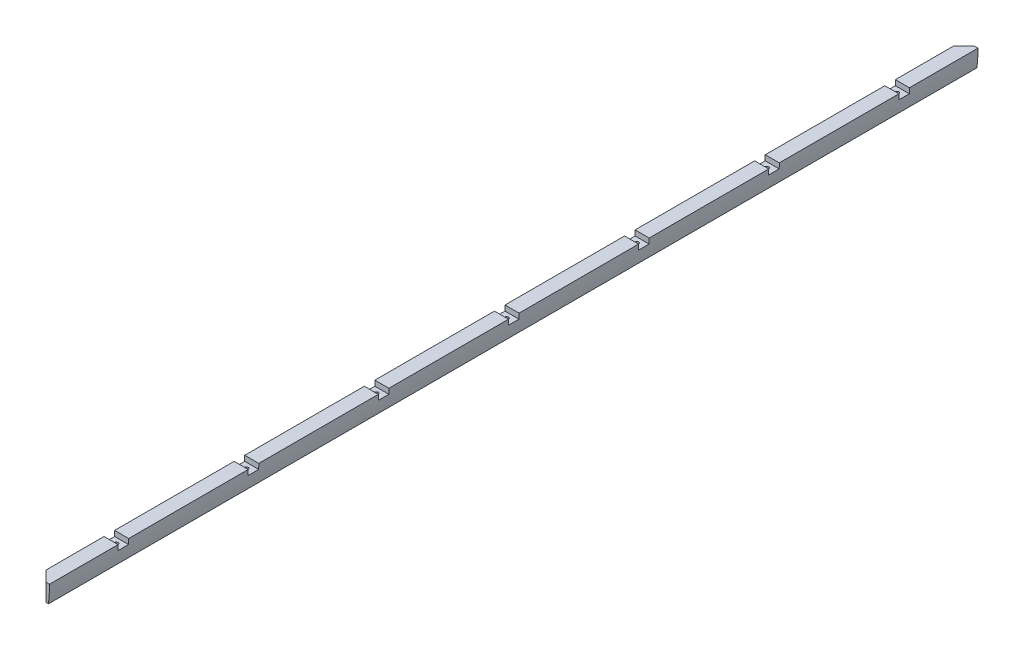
ISO-10303-21;
HEADER;
FILE_DESCRIPTION(('STEP AP214'),'2;1');
FILE_NAME('part.step','',(''),(''),'','','');
FILE_SCHEMA(('AUTOMOTIVE_DESIGN { 1 0 10303 214 1 1 1 1 }'));
ENDSEC;
DATA;
#1=APPLICATION_CONTEXT('core data for automotive mechanical design processes');
#2=APPLICATION_PROTOCOL_DEFINITION('international standard','automotive_design',2000,#1);
#3=PRODUCT_CONTEXT('',#1,'mechanical');
#4=PRODUCT('Part','Part','',(#3));
#5=PRODUCT_RELATED_PRODUCT_CATEGORY('part','',(#4));
#6=PRODUCT_DEFINITION_FORMATION('','',#4);
#7=PRODUCT_DEFINITION_CONTEXT('part definition',#1,'design');
#8=PRODUCT_DEFINITION('design','',#6,#7);
#9=PRODUCT_DEFINITION_SHAPE('','',#8);
#10=(LENGTH_UNIT() NAMED_UNIT(*) SI_UNIT(.MILLI.,.METRE.));
#11=(NAMED_UNIT(*) PLANE_ANGLE_UNIT() SI_UNIT($,.RADIAN.));
#12=(NAMED_UNIT(*) SI_UNIT($,.STERADIAN.) SOLID_ANGLE_UNIT());
#13=UNCERTAINTY_MEASURE_WITH_UNIT(LENGTH_MEASURE(1.E-05),#10,'distance_accuracy_value','');
#14=(GEOMETRIC_REPRESENTATION_CONTEXT(3) GLOBAL_UNCERTAINTY_ASSIGNED_CONTEXT((#13)) GLOBAL_UNIT_ASSIGNED_CONTEXT((#10,
#11,#12)) REPRESENTATION_CONTEXT('',''));
#15=CARTESIAN_POINT('',(0.,0.,0.));
#16=DIRECTION('',(0.,0.,1.));
#17=DIRECTION('',(1.,0.,0.));
#18=AXIS2_PLACEMENT_3D('',#15,#16,#17);
#19=CARTESIAN_POINT('',(234.95,0.,1676.4));
#20=DIRECTION('',(0.,-1.,0.));
#21=DIRECTION('',(0.,0.,-1.));
#22=AXIS2_PLACEMENT_3D('',#19,#20,#21);
#23=PLANE('',#22);
#24=DIRECTION('',(0.,0.,-1.));
#25=VECTOR('',#24,1.);
#26=CARTESIAN_POINT('',(234.95,0.,1676.4));
#27=LINE('',#26,#25);
#28=CARTESIAN_POINT('',(234.95,0.,1657.35));
#29=VERTEX_POINT('',#28);
#30=CARTESIAN_POINT('',(234.95,0.,1552.575));
#31=VERTEX_POINT('',#30);
#32=EDGE_CURVE('E275',#29,#31,#27,.T.);
#33=ORIENTED_EDGE('',*,*,#32,.F.);
#34=DIRECTION('',(-0.707106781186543,0.,-0.707106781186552));
#35=VECTOR('',#34,1.);
#36=CARTESIAN_POINT('',(254.,0.,1676.4));
#37=LINE('',#36,#35);
#38=CARTESIAN_POINT('',(254.,0.,1676.4));
#39=VERTEX_POINT('',#38);
#40=EDGE_CURVE('E422',#39,#29,#37,.T.);
#41=ORIENTED_EDGE('',*,*,#40,.F.);
#42=DIRECTION('',(-1.,0.,0.));
#43=VECTOR('',#42,1.);
#44=CARTESIAN_POINT('',(234.95,0.,1676.4));
#45=LINE('',#44,#43);
#46=CARTESIAN_POINT('',(260.35,0.,1676.4));
#47=VERTEX_POINT('',#46);
#48=EDGE_CURVE('E271',#47,#39,#45,.T.);
#49=ORIENTED_EDGE('',*,*,#48,.F.);
#50=DIRECTION('',(0.,0.,-1.));
#51=VECTOR('',#50,1.);
#52=CARTESIAN_POINT('',(260.35,0.,1676.4));
#53=LINE('',#52,#51);
#54=CARTESIAN_POINT('',(260.35,0.,1552.575));
#55=VERTEX_POINT('',#54);
#56=EDGE_CURVE('E285',#47,#55,#53,.T.);
#57=ORIENTED_EDGE('',*,*,#56,.T.);
#58=DIRECTION('',(1.,0.,0.));
#59=VECTOR('',#58,1.);
#60=CARTESIAN_POINT('',(352.397761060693,0.,1552.575));
#61=LINE('',#60,#59);
#62=EDGE_CURVE('E435',#31,#55,#61,.T.);
#63=ORIENTED_EDGE('',*,*,#62,.F.);
#64=EDGE_LOOP('',(#33,#41,#49,#57,#63));
#65=FACE_BOUND('',#64,.T.);
#66=ADVANCED_FACE('F32',(#65),#23,.F.);
#67=CARTESIAN_POINT('',(234.95,0.,1533.525));
#68=VERTEX_POINT('',#67);
#69=CARTESIAN_POINT('',(234.95,0.,1317.625));
#70=VERTEX_POINT('',#69);
#71=EDGE_CURVE('E284',#68,#70,#27,.T.);
#72=ORIENTED_EDGE('',*,*,#71,.F.);
#73=DIRECTION('',(-1.,0.,0.));
#74=VECTOR('',#73,1.);
#75=CARTESIAN_POINT('',(352.397761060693,0.,1533.525));
#76=LINE('',#75,#74);
#77=CARTESIAN_POINT('',(260.35,0.,1533.525));
#78=VERTEX_POINT('',#77);
#79=EDGE_CURVE('E357',#78,#68,#76,.T.);
#80=ORIENTED_EDGE('',*,*,#79,.F.);
#81=CARTESIAN_POINT('',(260.35,0.,1317.625));
#82=VERTEX_POINT('',#81);
#83=EDGE_CURVE('E289',#78,#82,#53,.T.);
#84=ORIENTED_EDGE('',*,*,#83,.T.);
#85=DIRECTION('',(1.,0.,0.));
#86=VECTOR('',#85,1.);
#87=CARTESIAN_POINT('',(352.397761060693,0.,1317.625));
#88=LINE('',#87,#86);
#89=EDGE_CURVE('E360',#70,#82,#88,.T.);
#90=ORIENTED_EDGE('',*,*,#89,.F.);
#91=EDGE_LOOP('',(#72,#80,#84,#90));
#92=FACE_BOUND('',#91,.T.);
#93=ADVANCED_FACE('F356',(#92),#23,.F.);
#94=CARTESIAN_POINT('',(234.95,0.,1298.575));
#95=VERTEX_POINT('',#94);
#96=CARTESIAN_POINT('',(234.95,0.,1082.675));
#97=VERTEX_POINT('',#96);
#98=EDGE_CURVE('E361',#95,#97,#27,.T.);
#99=ORIENTED_EDGE('',*,*,#98,.F.);
#100=DIRECTION('',(-1.,0.,0.));
#101=VECTOR('',#100,1.);
#102=CARTESIAN_POINT('',(352.397761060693,0.,1298.575));
#103=LINE('',#102,#101);
#104=CARTESIAN_POINT('',(260.35,0.,1298.575));
#105=VERTEX_POINT('',#104);
#106=EDGE_CURVE('E449',#105,#95,#103,.T.);
#107=ORIENTED_EDGE('',*,*,#106,.F.);
#108=CARTESIAN_POINT('',(260.35,0.,1082.675));
#109=VERTEX_POINT('',#108);
#110=EDGE_CURVE('E603',#105,#109,#53,.T.);
#111=ORIENTED_EDGE('',*,*,#110,.T.);
#112=DIRECTION('',(1.,0.,0.));
#113=VECTOR('',#112,1.);
#114=CARTESIAN_POINT('',(352.397761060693,0.,1082.675));
#115=LINE('',#114,#113);
#116=EDGE_CURVE('E470',#97,#109,#115,.T.);
#117=ORIENTED_EDGE('',*,*,#116,.F.);
#118=EDGE_LOOP('',(#99,#107,#111,#117));
#119=FACE_BOUND('',#118,.T.);
#120=ADVANCED_FACE('F564',(#119),#23,.F.);
#121=CARTESIAN_POINT('',(234.95,0.,1063.625));
#122=VERTEX_POINT('',#121);
#123=CARTESIAN_POINT('',(234.95,0.,847.725));
#124=VERTEX_POINT('',#123);
#125=EDGE_CURVE('E362',#122,#124,#27,.T.);
#126=ORIENTED_EDGE('',*,*,#125,.F.);
#127=DIRECTION('',(-1.,0.,0.));
#128=VECTOR('',#127,1.);
#129=CARTESIAN_POINT('',(352.397761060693,0.,1063.625));
#130=LINE('',#129,#128);
#131=CARTESIAN_POINT('',(260.35,0.,1063.625));
#132=VERTEX_POINT('',#131);
#133=EDGE_CURVE('E466',#132,#122,#130,.T.);
#134=ORIENTED_EDGE('',*,*,#133,.F.);
#135=CARTESIAN_POINT('',(260.35,0.,847.725));
#136=VERTEX_POINT('',#135);
#137=EDGE_CURVE('E599',#132,#136,#53,.T.);
#138=ORIENTED_EDGE('',*,*,#137,.T.);
#139=DIRECTION('',(1.,0.,0.));
#140=VECTOR('',#139,1.);
#141=CARTESIAN_POINT('',(352.397761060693,0.,847.725));
#142=LINE('',#141,#140);
#143=EDGE_CURVE('E489',#124,#136,#142,.T.);
#144=ORIENTED_EDGE('',*,*,#143,.F.);
#145=EDGE_LOOP('',(#126,#134,#138,#144));
#146=FACE_BOUND('',#145,.T.);
#147=ADVANCED_FACE('F585',(#146),#23,.F.);
#148=CARTESIAN_POINT('',(234.95,0.,828.675));
#149=VERTEX_POINT('',#148);
#150=CARTESIAN_POINT('',(234.95,0.,612.775));
#151=VERTEX_POINT('',#150);
#152=EDGE_CURVE('E365',#149,#151,#27,.T.);
#153=ORIENTED_EDGE('',*,*,#152,.F.);
#154=DIRECTION('',(-1.,0.,0.));
#155=VECTOR('',#154,1.);
#156=CARTESIAN_POINT('',(352.397761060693,0.,828.675));
#157=LINE('',#156,#155);
#158=CARTESIAN_POINT('',(260.35,0.,828.675));
#159=VERTEX_POINT('',#158);
#160=EDGE_CURVE('E485',#159,#149,#157,.T.);
#161=ORIENTED_EDGE('',*,*,#160,.F.);
#162=CARTESIAN_POINT('',(260.35,0.,612.775));
#163=VERTEX_POINT('',#162);
#164=EDGE_CURVE('E598',#159,#163,#53,.T.);
#165=ORIENTED_EDGE('',*,*,#164,.T.);
#166=DIRECTION('',(1.,0.,0.));
#167=VECTOR('',#166,1.);
#168=CARTESIAN_POINT('',(352.397761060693,0.,612.775));
#169=LINE('',#168,#167);
#170=EDGE_CURVE('E508',#151,#163,#169,.T.);
#171=ORIENTED_EDGE('',*,*,#170,.F.);
#172=EDGE_LOOP('',(#153,#161,#165,#171));
#173=FACE_BOUND('',#172,.T.);
#174=ADVANCED_FACE('F580',(#173),#23,.F.);
#175=CARTESIAN_POINT('',(234.95,0.,593.725));
#176=VERTEX_POINT('',#175);
#177=CARTESIAN_POINT('',(234.95,0.,377.825));
#178=VERTEX_POINT('',#177);
#179=EDGE_CURVE('E368',#176,#178,#27,.T.);
#180=ORIENTED_EDGE('',*,*,#179,.F.);
#181=DIRECTION('',(-1.,0.,0.));
#182=VECTOR('',#181,1.);
#183=CARTESIAN_POINT('',(352.397761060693,0.,593.725));
#184=LINE('',#183,#182);
#185=CARTESIAN_POINT('',(260.35,0.,593.725));
#186=VERTEX_POINT('',#185);
#187=EDGE_CURVE('E504',#186,#176,#184,.T.);
#188=ORIENTED_EDGE('',*,*,#187,.F.);
#189=CARTESIAN_POINT('',(260.35,0.,377.825));
#190=VERTEX_POINT('',#189);
#191=EDGE_CURVE('E590',#186,#190,#53,.T.);
#192=ORIENTED_EDGE('',*,*,#191,.T.);
#193=DIRECTION('',(1.,0.,0.));
#194=VECTOR('',#193,1.);
#195=CARTESIAN_POINT('',(352.397761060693,0.,377.825));
#196=LINE('',#195,#194);
#197=EDGE_CURVE('E527',#178,#190,#196,.T.);
#198=ORIENTED_EDGE('',*,*,#197,.F.);
#199=EDGE_LOOP('',(#180,#188,#192,#198));
#200=FACE_BOUND('',#199,.T.);
#201=ADVANCED_FACE('F574',(#200),#23,.F.);
#202=CARTESIAN_POINT('',(234.95,0.,358.775));
#203=VERTEX_POINT('',#202);
#204=CARTESIAN_POINT('',(234.95,0.,142.875));
#205=VERTEX_POINT('',#204);
#206=EDGE_CURVE('E273',#203,#205,#27,.T.);
#207=ORIENTED_EDGE('',*,*,#206,.F.);
#208=DIRECTION('',(-1.,0.,0.));
#209=VECTOR('',#208,1.);
#210=CARTESIAN_POINT('',(352.397761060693,0.,358.775));
#211=LINE('',#210,#209);
#212=CARTESIAN_POINT('',(260.35,0.,358.775));
#213=VERTEX_POINT('',#212);
#214=EDGE_CURVE('E523',#213,#203,#211,.T.);
#215=ORIENTED_EDGE('',*,*,#214,.F.);
#216=CARTESIAN_POINT('',(260.35,0.,142.875));
#217=VERTEX_POINT('',#216);
#218=EDGE_CURVE('E389',#213,#217,#53,.T.);
#219=ORIENTED_EDGE('',*,*,#218,.T.);
#220=DIRECTION('',(1.,0.,0.));
#221=VECTOR('',#220,1.);
#222=CARTESIAN_POINT('',(352.397761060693,0.,142.875));
#223=LINE('',#222,#221);
#224=EDGE_CURVE('E383',#205,#217,#223,.T.);
#225=ORIENTED_EDGE('',*,*,#224,.F.);
#226=EDGE_LOOP('',(#207,#215,#219,#225));
#227=FACE_BOUND('',#226,.T.);
#228=ADVANCED_FACE('F387',(#227),#23,.F.);
#229=CARTESIAN_POINT('',(234.95,-31.75,1676.4));
#230=DIRECTION('',(0.,1.,0.));
#231=DIRECTION('',(-1.,0.,0.));
#232=AXIS2_PLACEMENT_3D('',#229,#230,#231);
#233=PLANE('',#232);
#234=CARTESIAN_POINT('',(247.562851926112,-31.7500000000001,1543.05));
#235=DIRECTION('',(0.,1.,0.));
#236=DIRECTION('',(0.,0.,1.));
#237=AXIS2_PLACEMENT_3D('',#234,#235,#236);
#238=CIRCLE('',#237,3.3782);
#239=CARTESIAN_POINT('',(247.562851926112,-31.7500000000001,1546.4282));
#240=VERTEX_POINT('',#239);
#241=EDGE_CURVE('E1013',#240,#240,#238,.T.);
#242=ORIENTED_EDGE('',*,*,#241,.T.);
#243=EDGE_LOOP('',(#242));
#244=FACE_BOUND('',#243,.T.);
#245=CARTESIAN_POINT('',(247.562851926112,-31.7500000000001,1308.1));
#246=DIRECTION('',(0.,1.,0.));
#247=DIRECTION('',(0.,0.,1.));
#248=AXIS2_PLACEMENT_3D('',#245,#246,#247);
#249=CIRCLE('',#248,3.3782);
#250=CARTESIAN_POINT('',(247.562851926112,-31.7500000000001,1311.4782));
#251=VERTEX_POINT('',#250);
#252=EDGE_CURVE('E1007',#251,#251,#249,.T.);
#253=ORIENTED_EDGE('',*,*,#252,.T.);
#254=EDGE_LOOP('',(#253));
#255=FACE_BOUND('',#254,.T.);
#256=CARTESIAN_POINT('',(247.562851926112,-31.7500000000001,1073.15));
#257=DIRECTION('',(0.,1.,0.));
#258=DIRECTION('',(0.,0.,1.));
#259=AXIS2_PLACEMENT_3D('',#256,#257,#258);
#260=CIRCLE('',#259,3.3782);
#261=CARTESIAN_POINT('',(247.562851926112,-31.7500000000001,1076.5282));
#262=VERTEX_POINT('',#261);
#263=EDGE_CURVE('E967',#262,#262,#260,.T.);
#264=ORIENTED_EDGE('',*,*,#263,.T.);
#265=EDGE_LOOP('',(#264));
#266=FACE_BOUND('',#265,.T.);
#267=CARTESIAN_POINT('',(247.562851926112,-31.7500000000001,838.2));
#268=DIRECTION('',(0.,1.,0.));
#269=DIRECTION('',(0.,0.,1.));
#270=AXIS2_PLACEMENT_3D('',#267,#268,#269);
#271=CIRCLE('',#270,3.3782);
#272=CARTESIAN_POINT('',(247.562851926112,-31.7500000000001,841.5782));
#273=VERTEX_POINT('',#272);
#274=EDGE_CURVE('E966',#273,#273,#271,.T.);
#275=ORIENTED_EDGE('',*,*,#274,.T.);
#276=EDGE_LOOP('',(#275));
#277=FACE_BOUND('',#276,.T.);
#278=CARTESIAN_POINT('',(247.562851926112,-31.7500000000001,603.25));
#279=DIRECTION('',(0.,1.,0.));
#280=DIRECTION('',(0.,0.,1.));
#281=AXIS2_PLACEMENT_3D('',#278,#279,#280);
#282=CIRCLE('',#281,3.3782);
#283=CARTESIAN_POINT('',(247.562851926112,-31.7500000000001,606.6282));
#284=VERTEX_POINT('',#283);
#285=EDGE_CURVE('E979',#284,#284,#282,.T.);
#286=ORIENTED_EDGE('',*,*,#285,.T.);
#287=EDGE_LOOP('',(#286));
#288=FACE_BOUND('',#287,.T.);
#289=CARTESIAN_POINT('',(247.562851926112,-31.7500000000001,368.3));
#290=DIRECTION('',(0.,1.,0.));
#291=DIRECTION('',(0.,0.,1.));
#292=AXIS2_PLACEMENT_3D('',#289,#290,#291);
#293=CIRCLE('',#292,3.3782);
#294=CARTESIAN_POINT('',(247.562851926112,-31.7500000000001,371.6782));
#295=VERTEX_POINT('',#294);
#296=EDGE_CURVE('E985',#295,#295,#293,.T.);
#297=ORIENTED_EDGE('',*,*,#296,.T.);
#298=EDGE_LOOP('',(#297));
#299=FACE_BOUND('',#298,.T.);
#300=CARTESIAN_POINT('',(247.562851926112,-31.7500000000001,133.35));
#301=DIRECTION('',(0.,1.,0.));
#302=DIRECTION('',(0.,0.,1.));
#303=AXIS2_PLACEMENT_3D('',#300,#301,#302);
#304=CIRCLE('',#303,3.3782);
#305=CARTESIAN_POINT('',(247.562851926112,-31.7500000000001,136.7282));
#306=VERTEX_POINT('',#305);
#307=EDGE_CURVE('E991',#306,#306,#304,.T.);
#308=ORIENTED_EDGE('',*,*,#307,.T.);
#309=EDGE_LOOP('',(#308));
#310=FACE_BOUND('',#309,.T.);
#311=DIRECTION('',(0.,0.,-1.));
#312=VECTOR('',#311,1.);
#313=CARTESIAN_POINT('',(234.95,-31.75,1676.4));
#314=LINE('',#313,#312);
#315=CARTESIAN_POINT('',(234.95,-31.7500000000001,1657.35));
#316=VERTEX_POINT('',#315);
#317=CARTESIAN_POINT('',(234.95,-31.7500000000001,19.05));
#318=VERTEX_POINT('',#317);
#319=EDGE_CURVE('E265',#316,#318,#314,.T.);
#320=ORIENTED_EDGE('',*,*,#319,.T.);
#321=DIRECTION('',(0.707106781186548,0.,-0.707106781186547));
#322=VECTOR('',#321,1.);
#323=CARTESIAN_POINT('',(254.,-31.7500000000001,0.));
#324=LINE('',#323,#322);
#325=CARTESIAN_POINT('',(254.,-31.7500000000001,0.));
#326=VERTEX_POINT('',#325);
#327=EDGE_CURVE('E251',#318,#326,#324,.T.);
#328=ORIENTED_EDGE('',*,*,#327,.T.);
#329=DIRECTION('',(1.,0.,0.));
#330=VECTOR('',#329,1.);
#331=CARTESIAN_POINT('',(234.95,-31.75,0.));
#332=LINE('',#331,#330);
#333=CARTESIAN_POINT('',(258.406772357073,-31.7500000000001,0.));
#334=VERTEX_POINT('',#333);
#335=EDGE_CURVE('E406',#326,#334,#332,.T.);
#336=ORIENTED_EDGE('',*,*,#335,.T.);
#337=DIRECTION('',(0.,0.,-1.));
#338=VECTOR('',#337,1.);
#339=CARTESIAN_POINT('',(258.406772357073,-31.7500000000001,1676.4));
#340=LINE('',#339,#338);
#341=CARTESIAN_POINT('',(258.406772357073,-31.7500000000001,1676.4));
#342=VERTEX_POINT('',#341);
#343=EDGE_CURVE('E288',#342,#334,#340,.T.);
#344=ORIENTED_EDGE('',*,*,#343,.F.);
#345=DIRECTION('',(1.,0.,0.));
#346=VECTOR('',#345,1.);
#347=CARTESIAN_POINT('',(234.95,-31.75,1676.4));
#348=LINE('',#347,#346);
#349=CARTESIAN_POINT('',(254.,-31.75,1676.4));
#350=VERTEX_POINT('',#349);
#351=EDGE_CURVE('E407',#350,#342,#348,.T.);
#352=ORIENTED_EDGE('',*,*,#351,.F.);
#353=DIRECTION('',(-0.707106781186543,0.,-0.707106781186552));
#354=VECTOR('',#353,1.);
#355=CARTESIAN_POINT('',(254.,-31.7500000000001,1676.4));
#356=LINE('',#355,#354);
#357=EDGE_CURVE('E55',#350,#316,#356,.T.);
#358=ORIENTED_EDGE('',*,*,#357,.T.);
#359=EDGE_LOOP('',(#320,#328,#336,#344,#352,#358));
#360=FACE_BOUND('',#359,.T.);
#361=ADVANCED_FACE('F34',(#244,#255,#266,#277,#288,#299,#310,#360),#233,.F.);
#362=CARTESIAN_POINT('',(0.,0.,1676.4));
#363=DIRECTION('',(0.,0.,-1.));
#364=DIRECTION('',(-1.,0.,0.));
#365=AXIS2_PLACEMENT_3D('',#362,#363,#364);
#366=CYLINDRICAL_SURFACE('',#365,260.35);
#367=DIRECTION('',(0.,0.,-1.));
#368=VECTOR('',#367,1.);
#369=CARTESIAN_POINT('',(260.175703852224,-9.525,1676.4));
#370=LINE('',#369,#368);
#371=CARTESIAN_POINT('',(260.175703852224,-9.525,1533.525));
#372=VERTEX_POINT('',#371);
#373=CARTESIAN_POINT('',(260.175703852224,-9.525,1552.575));
#374=VERTEX_POINT('',#373);
#375=EDGE_CURVE('E438',#372,#374,#370,.F.);
#376=ORIENTED_EDGE('',*,*,#375,.T.);
#377=CARTESIAN_POINT('',(0.,0.,1552.575));
#378=DIRECTION('',(0.,0.,1.));
#379=DIRECTION('',(1.,0.,0.));
#380=AXIS2_PLACEMENT_3D('',#377,#378,#379);
#381=CIRCLE('',#380,260.35);
#382=EDGE_CURVE('E446',#374,#55,#381,.T.);
#383=ORIENTED_EDGE('',*,*,#382,.T.);
#384=ORIENTED_EDGE('',*,*,#56,.F.);
#385=CARTESIAN_POINT('',(0.,0.,1676.4));
#386=DIRECTION('',(0.,0.,1.));
#387=DIRECTION('',(1.,0.,0.));
#388=AXIS2_PLACEMENT_3D('',#385,#386,#387);
#389=CIRCLE('',#388,260.35);
#390=EDGE_CURVE('E277',#342,#47,#389,.T.);
#391=ORIENTED_EDGE('',*,*,#390,.F.);
#392=ORIENTED_EDGE('',*,*,#343,.T.);
#393=CARTESIAN_POINT('',(0.,0.,0.));
#394=DIRECTION('',(0.,0.,1.));
#395=DIRECTION('',(1.,0.,0.));
#396=AXIS2_PLACEMENT_3D('',#393,#394,#395);
#397=CIRCLE('',#396,260.35);
#398=CARTESIAN_POINT('',(260.35,0.,0.));
#399=VERTEX_POINT('',#398);
#400=EDGE_CURVE('E410',#334,#399,#397,.T.);
#401=ORIENTED_EDGE('',*,*,#400,.T.);
#402=CARTESIAN_POINT('',(260.35,0.,123.825));
#403=VERTEX_POINT('',#402);
#404=EDGE_CURVE('E283',#403,#399,#53,.T.);
#405=ORIENTED_EDGE('',*,*,#404,.F.);
#406=CARTESIAN_POINT('',(0.,0.,123.825));
#407=DIRECTION('',(0.,0.,-1.));
#408=DIRECTION('',(-1.,0.,0.));
#409=AXIS2_PLACEMENT_3D('',#406,#407,#408);
#410=CIRCLE('',#409,260.35);
#411=CARTESIAN_POINT('',(260.175703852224,-9.525,123.825));
#412=VERTEX_POINT('',#411);
#413=EDGE_CURVE('E401',#403,#412,#410,.T.);
#414=ORIENTED_EDGE('',*,*,#413,.T.);
#415=DIRECTION('',(0.,0.,-1.));
#416=VECTOR('',#415,1.);
#417=CARTESIAN_POINT('',(260.175703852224,-9.525,1676.4));
#418=LINE('',#417,#416);
#419=CARTESIAN_POINT('',(260.175703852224,-9.525,142.875));
#420=VERTEX_POINT('',#419);
#421=EDGE_CURVE('E398',#412,#420,#418,.F.);
#422=ORIENTED_EDGE('',*,*,#421,.T.);
#423=CARTESIAN_POINT('',(0.,0.,142.875));
#424=DIRECTION('',(0.,0.,1.));
#425=DIRECTION('',(1.,0.,0.));
#426=AXIS2_PLACEMENT_3D('',#423,#424,#425);
#427=CIRCLE('',#426,260.35);
#428=EDGE_CURVE('E404',#420,#217,#427,.T.);
#429=ORIENTED_EDGE('',*,*,#428,.T.);
#430=ORIENTED_EDGE('',*,*,#218,.F.);
#431=CARTESIAN_POINT('',(0.,0.,358.775));
#432=DIRECTION('',(0.,0.,-1.));
#433=DIRECTION('',(-1.,0.,0.));
#434=AXIS2_PLACEMENT_3D('',#431,#432,#433);
#435=CIRCLE('',#434,260.35);
#436=CARTESIAN_POINT('',(260.175703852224,-9.525,358.775));
#437=VERTEX_POINT('',#436);
#438=EDGE_CURVE('E536',#213,#437,#435,.T.);
#439=ORIENTED_EDGE('',*,*,#438,.T.);
#440=DIRECTION('',(0.,0.,-1.));
#441=VECTOR('',#440,1.);
#442=CARTESIAN_POINT('',(260.175703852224,-9.525,1676.4));
#443=LINE('',#442,#441);
#444=CARTESIAN_POINT('',(260.175703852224,-9.525,377.825));
#445=VERTEX_POINT('',#444);
#446=EDGE_CURVE('E530',#437,#445,#443,.F.);
#447=ORIENTED_EDGE('',*,*,#446,.T.);
#448=CARTESIAN_POINT('',(0.,0.,377.825));
#449=DIRECTION('',(0.,0.,1.));
#450=DIRECTION('',(1.,0.,0.));
#451=AXIS2_PLACEMENT_3D('',#448,#449,#450);
#452=CIRCLE('',#451,260.35);
#453=EDGE_CURVE('E394',#445,#190,#452,.T.);
#454=ORIENTED_EDGE('',*,*,#453,.T.);
#455=ORIENTED_EDGE('',*,*,#191,.F.);
#456=CARTESIAN_POINT('',(0.,0.,593.725));
#457=DIRECTION('',(0.,0.,-1.));
#458=DIRECTION('',(-1.,0.,0.));
#459=AXIS2_PLACEMENT_3D('',#456,#457,#458);
#460=CIRCLE('',#459,260.35);
#461=CARTESIAN_POINT('',(260.175703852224,-9.525,593.725));
#462=VERTEX_POINT('',#461);
#463=EDGE_CURVE('E517',#186,#462,#460,.T.);
#464=ORIENTED_EDGE('',*,*,#463,.T.);
#465=DIRECTION('',(0.,0.,-1.));
#466=VECTOR('',#465,1.);
#467=CARTESIAN_POINT('',(260.175703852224,-9.525,1676.4));
#468=LINE('',#467,#466);
#469=CARTESIAN_POINT('',(260.175703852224,-9.525,612.775));
#470=VERTEX_POINT('',#469);
#471=EDGE_CURVE('E511',#462,#470,#468,.F.);
#472=ORIENTED_EDGE('',*,*,#471,.T.);
#473=CARTESIAN_POINT('',(0.,0.,612.775));
#474=DIRECTION('',(0.,0.,1.));
#475=DIRECTION('',(1.,0.,0.));
#476=AXIS2_PLACEMENT_3D('',#473,#474,#475);
#477=CIRCLE('',#476,260.35);
#478=EDGE_CURVE('E520',#470,#163,#477,.T.);
#479=ORIENTED_EDGE('',*,*,#478,.T.);
#480=ORIENTED_EDGE('',*,*,#164,.F.);
#481=CARTESIAN_POINT('',(0.,0.,828.675));
#482=DIRECTION('',(0.,0.,-1.));
#483=DIRECTION('',(-1.,0.,0.));
#484=AXIS2_PLACEMENT_3D('',#481,#482,#483);
#485=CIRCLE('',#484,260.35);
#486=CARTESIAN_POINT('',(260.175703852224,-9.525,828.675));
#487=VERTEX_POINT('',#486);
#488=EDGE_CURVE('E498',#159,#487,#485,.T.);
#489=ORIENTED_EDGE('',*,*,#488,.T.);
#490=DIRECTION('',(0.,0.,-1.));
#491=VECTOR('',#490,1.);
#492=CARTESIAN_POINT('',(260.175703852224,-9.525,1676.4));
#493=LINE('',#492,#491);
#494=CARTESIAN_POINT('',(260.175703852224,-9.525,847.725));
#495=VERTEX_POINT('',#494);
#496=EDGE_CURVE('E492',#487,#495,#493,.F.);
#497=ORIENTED_EDGE('',*,*,#496,.T.);
#498=CARTESIAN_POINT('',(0.,0.,847.725));
#499=DIRECTION('',(0.,0.,1.));
#500=DIRECTION('',(1.,0.,0.));
#501=AXIS2_PLACEMENT_3D('',#498,#499,#500);
#502=CIRCLE('',#501,260.35);
#503=EDGE_CURVE('E501',#495,#136,#502,.T.);
#504=ORIENTED_EDGE('',*,*,#503,.T.);
#505=ORIENTED_EDGE('',*,*,#137,.F.);
#506=CARTESIAN_POINT('',(0.,0.,1063.625));
#507=DIRECTION('',(0.,0.,-1.));
#508=DIRECTION('',(-1.,0.,0.));
#509=AXIS2_PLACEMENT_3D('',#506,#507,#508);
#510=CIRCLE('',#509,260.35);
#511=CARTESIAN_POINT('',(260.175703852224,-9.525,1063.625));
#512=VERTEX_POINT('',#511);
#513=EDGE_CURVE('E479',#132,#512,#510,.T.);
#514=ORIENTED_EDGE('',*,*,#513,.T.);
#515=DIRECTION('',(0.,0.,-1.));
#516=VECTOR('',#515,1.);
#517=CARTESIAN_POINT('',(260.175703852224,-9.525,1676.4));
#518=LINE('',#517,#516);
#519=CARTESIAN_POINT('',(260.175703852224,-9.525,1082.675));
#520=VERTEX_POINT('',#519);
#521=EDGE_CURVE('E473',#512,#520,#518,.F.);
#522=ORIENTED_EDGE('',*,*,#521,.T.);
#523=CARTESIAN_POINT('',(0.,0.,1082.675));
#524=DIRECTION('',(0.,0.,1.));
#525=DIRECTION('',(1.,0.,0.));
#526=AXIS2_PLACEMENT_3D('',#523,#524,#525);
#527=CIRCLE('',#526,260.35);
#528=EDGE_CURVE('E482',#520,#109,#527,.T.);
#529=ORIENTED_EDGE('',*,*,#528,.T.);
#530=ORIENTED_EDGE('',*,*,#110,.F.);
#531=CARTESIAN_POINT('',(0.,0.,1298.575));
#532=DIRECTION('',(0.,0.,-1.));
#533=DIRECTION('',(-1.,0.,0.));
#534=AXIS2_PLACEMENT_3D('',#531,#532,#533);
#535=CIRCLE('',#534,260.35);
#536=CARTESIAN_POINT('',(260.175703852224,-9.525,1298.575));
#537=VERTEX_POINT('',#536);
#538=EDGE_CURVE('E460',#105,#537,#535,.T.);
#539=ORIENTED_EDGE('',*,*,#538,.T.);
#540=DIRECTION('',(0.,0.,-1.));
#541=VECTOR('',#540,1.);
#542=CARTESIAN_POINT('',(260.175703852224,-9.525,1676.4));
#543=LINE('',#542,#541);
#544=CARTESIAN_POINT('',(260.175703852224,-9.525,1317.625));
#545=VERTEX_POINT('',#544);
#546=EDGE_CURVE('E455',#537,#545,#543,.F.);
#547=ORIENTED_EDGE('',*,*,#546,.T.);
#548=CARTESIAN_POINT('',(0.,0.,1317.625));
#549=DIRECTION('',(0.,0.,1.));
#550=DIRECTION('',(1.,0.,0.));
#551=AXIS2_PLACEMENT_3D('',#548,#549,#550);
#552=CIRCLE('',#551,260.35);
#553=EDGE_CURVE('E463',#545,#82,#552,.T.);
#554=ORIENTED_EDGE('',*,*,#553,.T.);
#555=ORIENTED_EDGE('',*,*,#83,.F.);
#556=CARTESIAN_POINT('',(0.,0.,1533.525));
#557=DIRECTION('',(0.,0.,-1.));
#558=DIRECTION('',(-1.,0.,0.));
#559=AXIS2_PLACEMENT_3D('',#556,#557,#558);
#560=CIRCLE('',#559,260.35);
#561=EDGE_CURVE('E443',#78,#372,#560,.T.);
#562=ORIENTED_EDGE('',*,*,#561,.T.);
#563=EDGE_LOOP('',(#376,#383,#384,#391,#392,#401,#405,#414,#422,#429,#430,#439,#447,#454,#455,
#464,#472,#479,#480,#489,#497,#504,#505,#514,#522,#529,#530,#539,#547,#554,#555,#562));
#564=FACE_BOUND('',#563,.T.);
#565=ADVANCED_FACE('F543',(#564),#366,.T.);
#566=DIRECTION('',(-1.,0.,0.));
#567=VECTOR('',#566,1.);
#568=CARTESIAN_POINT('',(234.95,0.,0.));
#569=LINE('',#568,#567);
#570=CARTESIAN_POINT('',(254.,0.,0.));
#571=VERTEX_POINT('',#570);
#572=EDGE_CURVE('E280',#399,#571,#569,.T.);
#573=ORIENTED_EDGE('',*,*,#572,.T.);
#574=DIRECTION('',(0.707106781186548,0.,-0.707106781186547));
#575=VECTOR('',#574,1.);
#576=CARTESIAN_POINT('',(254.,0.,0.));
#577=LINE('',#576,#575);
#578=CARTESIAN_POINT('',(234.95,0.,19.05));
#579=VERTEX_POINT('',#578);
#580=EDGE_CURVE('E47',#579,#571,#577,.T.);
#581=ORIENTED_EDGE('',*,*,#580,.F.);
#582=CARTESIAN_POINT('',(234.95,0.,123.825));
#583=VERTEX_POINT('',#582);
#584=EDGE_CURVE('E268',#583,#579,#27,.T.);
#585=ORIENTED_EDGE('',*,*,#584,.F.);
#586=DIRECTION('',(-1.,0.,0.));
#587=VECTOR('',#586,1.);
#588=CARTESIAN_POINT('',(352.397761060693,0.,123.825));
#589=LINE('',#588,#587);
#590=EDGE_CURVE('E391',#403,#583,#589,.T.);
#591=ORIENTED_EDGE('',*,*,#590,.F.);
#592=ORIENTED_EDGE('',*,*,#404,.T.);
#593=EDGE_LOOP('',(#573,#581,#585,#591,#592));
#594=FACE_BOUND('',#593,.T.);
#595=ADVANCED_FACE('F418',(#594),#23,.F.);
#596=CARTESIAN_POINT('',(234.95,0.,1676.4));
#597=DIRECTION('',(1.,0.,0.));
#598=DIRECTION('',(0.,0.,-1.));
#599=AXIS2_PLACEMENT_3D('',#596,#597,#598);
#600=PLANE('',#599);
#601=ORIENTED_EDGE('',*,*,#584,.T.);
#602=DIRECTION('',(0.,1.,0.));
#603=VECTOR('',#602,1.);
#604=CARTESIAN_POINT('',(234.95,-31.7500000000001,19.05));
#605=LINE('',#604,#603);
#606=EDGE_CURVE('E254',#318,#579,#605,.T.);
#607=ORIENTED_EDGE('',*,*,#606,.F.);
#608=ORIENTED_EDGE('',*,*,#319,.F.);
#609=DIRECTION('',(0.,1.,0.));
#610=VECTOR('',#609,1.);
#611=CARTESIAN_POINT('',(234.95,-31.7500000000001,1657.35));
#612=LINE('',#611,#610);
#613=EDGE_CURVE('E429',#316,#29,#612,.T.);
#614=ORIENTED_EDGE('',*,*,#613,.T.);
#615=ORIENTED_EDGE('',*,*,#32,.T.);
#616=DIRECTION('',(0.,-1.,0.));
#617=VECTOR('',#616,1.);
#618=CARTESIAN_POINT('',(234.95,0.,1552.575));
#619=LINE('',#618,#617);
#620=CARTESIAN_POINT('',(234.95,-9.525,1552.575));
#621=VERTEX_POINT('',#620);
#622=EDGE_CURVE('E11',#31,#621,#619,.T.);
#623=ORIENTED_EDGE('',*,*,#622,.T.);
#624=DIRECTION('',(0.,0.,-1.));
#625=VECTOR('',#624,1.);
#626=CARTESIAN_POINT('',(234.95,-9.525,1676.4));
#627=LINE('',#626,#625);
#628=CARTESIAN_POINT('',(234.95,-9.525,1533.525));
#629=VERTEX_POINT('',#628);
#630=EDGE_CURVE('E345',#621,#629,#627,.T.);
#631=ORIENTED_EDGE('',*,*,#630,.T.);
#632=DIRECTION('',(0.,1.,0.));
#633=VECTOR('',#632,1.);
#634=CARTESIAN_POINT('',(234.95,0.,1533.525));
#635=LINE('',#634,#633);
#636=EDGE_CURVE('E40',#629,#68,#635,.T.);
#637=ORIENTED_EDGE('',*,*,#636,.T.);
#638=ORIENTED_EDGE('',*,*,#71,.T.);
#639=DIRECTION('',(0.,-1.,0.));
#640=VECTOR('',#639,1.);
#641=CARTESIAN_POINT('',(234.95,0.,1317.625));
#642=LINE('',#641,#640);
#643=CARTESIAN_POINT('',(234.95,-9.525,1317.625));
#644=VERTEX_POINT('',#643);
#645=EDGE_CURVE('E342',#70,#644,#642,.T.);
#646=ORIENTED_EDGE('',*,*,#645,.T.);
#647=DIRECTION('',(0.,0.,-1.));
#648=VECTOR('',#647,1.);
#649=CARTESIAN_POINT('',(234.95,-9.525,1676.4));
#650=LINE('',#649,#648);
#651=CARTESIAN_POINT('',(234.95,-9.525,1298.575));
#652=VERTEX_POINT('',#651);
#653=EDGE_CURVE('E336',#644,#652,#650,.T.);
#654=ORIENTED_EDGE('',*,*,#653,.T.);
#655=DIRECTION('',(0.,1.,0.));
#656=VECTOR('',#655,1.);
#657=CARTESIAN_POINT('',(234.95,0.,1298.575));
#658=LINE('',#657,#656);
#659=EDGE_CURVE('E339',#652,#95,#658,.T.);
#660=ORIENTED_EDGE('',*,*,#659,.T.);
#661=ORIENTED_EDGE('',*,*,#98,.T.);
#662=DIRECTION('',(0.,-1.,0.));
#663=VECTOR('',#662,1.);
#664=CARTESIAN_POINT('',(234.95,0.,1082.675));
#665=LINE('',#664,#663);
#666=CARTESIAN_POINT('',(234.95,-9.525,1082.675));
#667=VERTEX_POINT('',#666);
#668=EDGE_CURVE('E333',#97,#667,#665,.T.);
#669=ORIENTED_EDGE('',*,*,#668,.T.);
#670=DIRECTION('',(0.,0.,-1.));
#671=VECTOR('',#670,1.);
#672=CARTESIAN_POINT('',(234.95,-9.525,1676.4));
#673=LINE('',#672,#671);
#674=CARTESIAN_POINT('',(234.95,-9.525,1063.625));
#675=VERTEX_POINT('',#674);
#676=EDGE_CURVE('E327',#667,#675,#673,.T.);
#677=ORIENTED_EDGE('',*,*,#676,.T.);
#678=DIRECTION('',(0.,1.,0.));
#679=VECTOR('',#678,1.);
#680=CARTESIAN_POINT('',(234.95,0.,1063.625));
#681=LINE('',#680,#679);
#682=EDGE_CURVE('E330',#675,#122,#681,.T.);
#683=ORIENTED_EDGE('',*,*,#682,.T.);
#684=ORIENTED_EDGE('',*,*,#125,.T.);
#685=DIRECTION('',(0.,-1.,0.));
#686=VECTOR('',#685,1.);
#687=CARTESIAN_POINT('',(234.95,0.,847.725));
#688=LINE('',#687,#686);
#689=CARTESIAN_POINT('',(234.95,-9.525,847.725));
#690=VERTEX_POINT('',#689);
#691=EDGE_CURVE('E324',#124,#690,#688,.T.);
#692=ORIENTED_EDGE('',*,*,#691,.T.);
#693=DIRECTION('',(0.,0.,-1.));
#694=VECTOR('',#693,1.);
#695=CARTESIAN_POINT('',(234.95,-9.525,1676.4));
#696=LINE('',#695,#694);
#697=CARTESIAN_POINT('',(234.95,-9.525,828.675));
#698=VERTEX_POINT('',#697);
#699=EDGE_CURVE('E318',#690,#698,#696,.T.);
#700=ORIENTED_EDGE('',*,*,#699,.T.);
#701=DIRECTION('',(0.,1.,0.));
#702=VECTOR('',#701,1.);
#703=CARTESIAN_POINT('',(234.95,0.,828.675));
#704=LINE('',#703,#702);
#705=EDGE_CURVE('E321',#698,#149,#704,.T.);
#706=ORIENTED_EDGE('',*,*,#705,.T.);
#707=ORIENTED_EDGE('',*,*,#152,.T.);
#708=DIRECTION('',(0.,-1.,0.));
#709=VECTOR('',#708,1.);
#710=CARTESIAN_POINT('',(234.95,0.,612.775));
#711=LINE('',#710,#709);
#712=CARTESIAN_POINT('',(234.95,-9.525,612.775));
#713=VERTEX_POINT('',#712);
#714=EDGE_CURVE('E315',#151,#713,#711,.T.);
#715=ORIENTED_EDGE('',*,*,#714,.T.);
#716=DIRECTION('',(0.,0.,-1.));
#717=VECTOR('',#716,1.);
#718=CARTESIAN_POINT('',(234.95,-9.525,1676.4));
#719=LINE('',#718,#717);
#720=CARTESIAN_POINT('',(234.95,-9.525,593.725));
#721=VERTEX_POINT('',#720);
#722=EDGE_CURVE('E309',#713,#721,#719,.T.);
#723=ORIENTED_EDGE('',*,*,#722,.T.);
#724=DIRECTION('',(0.,1.,0.));
#725=VECTOR('',#724,1.);
#726=CARTESIAN_POINT('',(234.95,0.,593.725));
#727=LINE('',#726,#725);
#728=EDGE_CURVE('E312',#721,#176,#727,.T.);
#729=ORIENTED_EDGE('',*,*,#728,.T.);
#730=ORIENTED_EDGE('',*,*,#179,.T.);
#731=DIRECTION('',(0.,-1.,0.));
#732=VECTOR('',#731,1.);
#733=CARTESIAN_POINT('',(234.95,0.,377.825));
#734=LINE('',#733,#732);
#735=CARTESIAN_POINT('',(234.95,-9.525,377.825));
#736=VERTEX_POINT('',#735);
#737=EDGE_CURVE('E306',#178,#736,#734,.T.);
#738=ORIENTED_EDGE('',*,*,#737,.T.);
#739=DIRECTION('',(0.,0.,-1.));
#740=VECTOR('',#739,1.);
#741=CARTESIAN_POINT('',(234.95,-9.525,1676.4));
#742=LINE('',#741,#740);
#743=CARTESIAN_POINT('',(234.95,-9.525,358.775));
#744=VERTEX_POINT('',#743);
#745=EDGE_CURVE('E300',#736,#744,#742,.T.);
#746=ORIENTED_EDGE('',*,*,#745,.T.);
#747=DIRECTION('',(0.,1.,0.));
#748=VECTOR('',#747,1.);
#749=CARTESIAN_POINT('',(234.95,0.,358.775));
#750=LINE('',#749,#748);
#751=EDGE_CURVE('E303',#744,#203,#750,.T.);
#752=ORIENTED_EDGE('',*,*,#751,.T.);
#753=ORIENTED_EDGE('',*,*,#206,.T.);
#754=DIRECTION('',(0.,-1.,0.));
#755=VECTOR('',#754,1.);
#756=CARTESIAN_POINT('',(234.95,0.,142.875));
#757=LINE('',#756,#755);
#758=CARTESIAN_POINT('',(234.95,-9.525,142.875));
#759=VERTEX_POINT('',#758);
#760=EDGE_CURVE('E297',#205,#759,#757,.T.);
#761=ORIENTED_EDGE('',*,*,#760,.T.);
#762=DIRECTION('',(0.,0.,-1.));
#763=VECTOR('',#762,1.);
#764=CARTESIAN_POINT('',(234.95,-9.525,1676.4));
#765=LINE('',#764,#763);
#766=CARTESIAN_POINT('',(234.95,-9.525,123.825));
#767=VERTEX_POINT('',#766);
#768=EDGE_CURVE('E292',#759,#767,#765,.T.);
#769=ORIENTED_EDGE('',*,*,#768,.T.);
#770=DIRECTION('',(0.,1.,0.));
#771=VECTOR('',#770,1.);
#772=CARTESIAN_POINT('',(234.95,0.,123.825));
#773=LINE('',#772,#771);
#774=EDGE_CURVE('E295',#767,#583,#773,.T.);
#775=ORIENTED_EDGE('',*,*,#774,.T.);
#776=EDGE_LOOP('',(#601,#607,#608,#614,#615,#623,#631,#637,#638,#646,#654,#660,#661,#669,#677,
#683,#684,#692,#700,#706,#707,#715,#723,#729,#730,#738,#746,#752,#753,#761,#769,#775));
#777=FACE_BOUND('',#776,.T.);
#778=ADVANCED_FACE('F263',(#777),#600,.F.);
#779=CARTESIAN_POINT('',(0.,0.,1676.4));
#780=DIRECTION('',(0.,0.,1.));
#781=DIRECTION('',(1.,0.,0.));
#782=AXIS2_PLACEMENT_3D('',#779,#780,#781);
#783=PLANE('',#782);
#784=DIRECTION('',(0.,1.,0.));
#785=VECTOR('',#784,1.);
#786=CARTESIAN_POINT('',(254.,-31.7500000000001,1676.4));
#787=LINE('',#786,#785);
#788=EDGE_CURVE('E427',#350,#39,#787,.T.);
#789=ORIENTED_EDGE('',*,*,#788,.F.);
#790=ORIENTED_EDGE('',*,*,#351,.T.);
#791=ORIENTED_EDGE('',*,*,#390,.T.);
#792=ORIENTED_EDGE('',*,*,#48,.T.);
#793=EDGE_LOOP('',(#789,#790,#791,#792));
#794=FACE_BOUND('',#793,.T.);
#795=ADVANCED_FACE('F572',(#794),#783,.T.);
#796=CARTESIAN_POINT('',(0.,0.,0.));
#797=DIRECTION('',(0.,0.,1.));
#798=DIRECTION('',(1.,0.,0.));
#799=AXIS2_PLACEMENT_3D('',#796,#797,#798);
#800=PLANE('',#799);
#801=ORIENTED_EDGE('',*,*,#335,.F.);
#802=DIRECTION('',(0.,1.,0.));
#803=VECTOR('',#802,1.);
#804=CARTESIAN_POINT('',(254.,-31.7500000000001,0.));
#805=LINE('',#804,#803);
#806=EDGE_CURVE('E255',#326,#571,#805,.T.);
#807=ORIENTED_EDGE('',*,*,#806,.T.);
#808=ORIENTED_EDGE('',*,*,#572,.F.);
#809=ORIENTED_EDGE('',*,*,#400,.F.);
#810=EDGE_LOOP('',(#801,#807,#808,#809));
#811=FACE_BOUND('',#810,.T.);
#812=ADVANCED_FACE('F421',(#811),#800,.F.);
#813=CARTESIAN_POINT('',(352.397761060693,-9.525,142.875));
#814=DIRECTION('',(0.,0.,1.));
#815=DIRECTION('',(1.,0.,0.));
#816=AXIS2_PLACEMENT_3D('',#813,#814,#815);
#817=PLANE('',#816);
#818=DIRECTION('',(1.,0.,0.));
#819=VECTOR('',#818,1.);
#820=CARTESIAN_POINT('',(352.397761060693,-9.525,142.875));
#821=LINE('',#820,#819);
#822=EDGE_CURVE('E386',#759,#420,#821,.T.);
#823=ORIENTED_EDGE('',*,*,#822,.F.);
#824=ORIENTED_EDGE('',*,*,#760,.F.);
#825=ORIENTED_EDGE('',*,*,#224,.T.);
#826=ORIENTED_EDGE('',*,*,#428,.F.);
#827=EDGE_LOOP('',(#823,#824,#825,#826));
#828=FACE_BOUND('',#827,.T.);
#829=ADVANCED_FACE('F382',(#828),#817,.F.);
#830=CARTESIAN_POINT('',(352.397761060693,-9.525,123.825));
#831=DIRECTION('',(0.,0.,-1.));
#832=DIRECTION('',(-1.,0.,0.));
#833=AXIS2_PLACEMENT_3D('',#830,#831,#832);
#834=PLANE('',#833);
#835=ORIENTED_EDGE('',*,*,#590,.T.);
#836=ORIENTED_EDGE('',*,*,#774,.F.);
#837=DIRECTION('',(-1.,0.,0.));
#838=VECTOR('',#837,1.);
#839=CARTESIAN_POINT('',(352.397761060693,-9.525,123.825));
#840=LINE('',#839,#838);
#841=EDGE_CURVE('E390',#412,#767,#840,.T.);
#842=ORIENTED_EDGE('',*,*,#841,.F.);
#843=ORIENTED_EDGE('',*,*,#413,.F.);
#844=EDGE_LOOP('',(#835,#836,#842,#843));
#845=FACE_BOUND('',#844,.T.);
#846=ADVANCED_FACE('F545',(#845),#834,.F.);
#847=CARTESIAN_POINT('',(352.397761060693,-9.525,142.875));
#848=DIRECTION('',(0.,-1.,0.));
#849=DIRECTION('',(0.,0.,-1.));
#850=AXIS2_PLACEMENT_3D('',#847,#848,#849);
#851=PLANE('',#850);
#852=CARTESIAN_POINT('',(247.562851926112,-9.525,133.35));
#853=DIRECTION('',(0.,1.,0.));
#854=DIRECTION('',(0.,0.,1.));
#855=AXIS2_PLACEMENT_3D('',#852,#853,#854);
#856=CIRCLE('',#855,3.3782);
#857=CARTESIAN_POINT('',(247.562851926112,-9.525,136.7282));
#858=VERTEX_POINT('',#857);
#859=EDGE_CURVE('E988',#858,#858,#856,.T.);
#860=ORIENTED_EDGE('',*,*,#859,.F.);
#861=EDGE_LOOP('',(#860));
#862=FACE_BOUND('',#861,.T.);
#863=ORIENTED_EDGE('',*,*,#841,.T.);
#864=ORIENTED_EDGE('',*,*,#768,.F.);
#865=ORIENTED_EDGE('',*,*,#822,.T.);
#866=ORIENTED_EDGE('',*,*,#421,.F.);
#867=EDGE_LOOP('',(#863,#864,#865,#866));
#868=FACE_BOUND('',#867,.T.);
#869=ADVANCED_FACE('F541',(#862,#868),#851,.F.);
#870=CARTESIAN_POINT('',(352.397761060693,-9.525,377.825));
#871=DIRECTION('',(0.,0.,1.));
#872=DIRECTION('',(1.,0.,0.));
#873=AXIS2_PLACEMENT_3D('',#870,#871,#872);
#874=PLANE('',#873);
#875=DIRECTION('',(1.,0.,0.));
#876=VECTOR('',#875,1.);
#877=CARTESIAN_POINT('',(352.397761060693,-9.525,377.825));
#878=LINE('',#877,#876);
#879=EDGE_CURVE('E526',#736,#445,#878,.T.);
#880=ORIENTED_EDGE('',*,*,#879,.F.);
#881=ORIENTED_EDGE('',*,*,#737,.F.);
#882=ORIENTED_EDGE('',*,*,#197,.T.);
#883=ORIENTED_EDGE('',*,*,#453,.F.);
#884=EDGE_LOOP('',(#880,#881,#882,#883));
#885=FACE_BOUND('',#884,.T.);
#886=ADVANCED_FACE('F553',(#885),#874,.F.);
#887=CARTESIAN_POINT('',(352.397761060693,-9.525,358.775));
#888=DIRECTION('',(0.,0.,-1.));
#889=DIRECTION('',(-1.,0.,0.));
#890=AXIS2_PLACEMENT_3D('',#887,#888,#889);
#891=PLANE('',#890);
#892=ORIENTED_EDGE('',*,*,#214,.T.);
#893=ORIENTED_EDGE('',*,*,#751,.F.);
#894=DIRECTION('',(-1.,0.,0.));
#895=VECTOR('',#894,1.);
#896=CARTESIAN_POINT('',(352.397761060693,-9.525,358.775));
#897=LINE('',#896,#895);
#898=EDGE_CURVE('E524',#437,#744,#897,.T.);
#899=ORIENTED_EDGE('',*,*,#898,.F.);
#900=ORIENTED_EDGE('',*,*,#438,.F.);
#901=EDGE_LOOP('',(#892,#893,#899,#900));
#902=FACE_BOUND('',#901,.T.);
#903=ADVANCED_FACE('F597',(#902),#891,.F.);
#904=CARTESIAN_POINT('',(352.397761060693,-9.525,377.825));
#905=DIRECTION('',(0.,-1.,0.));
#906=DIRECTION('',(0.,0.,-1.));
#907=AXIS2_PLACEMENT_3D('',#904,#905,#906);
#908=PLANE('',#907);
#909=CARTESIAN_POINT('',(247.562851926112,-9.525,368.3));
#910=DIRECTION('',(0.,1.,0.));
#911=DIRECTION('',(0.,0.,1.));
#912=AXIS2_PLACEMENT_3D('',#909,#910,#911);
#913=CIRCLE('',#912,3.3782);
#914=CARTESIAN_POINT('',(247.562851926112,-9.525,371.6782));
#915=VERTEX_POINT('',#914);
#916=EDGE_CURVE('E982',#915,#915,#913,.T.);
#917=ORIENTED_EDGE('',*,*,#916,.F.);
#918=EDGE_LOOP('',(#917));
#919=FACE_BOUND('',#918,.T.);
#920=ORIENTED_EDGE('',*,*,#898,.T.);
#921=ORIENTED_EDGE('',*,*,#745,.F.);
#922=ORIENTED_EDGE('',*,*,#879,.T.);
#923=ORIENTED_EDGE('',*,*,#446,.F.);
#924=EDGE_LOOP('',(#920,#921,#922,#923));
#925=FACE_BOUND('',#924,.T.);
#926=ADVANCED_FACE('F595',(#919,#925),#908,.F.);
#927=CARTESIAN_POINT('',(352.397761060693,-9.525,612.775));
#928=DIRECTION('',(0.,0.,1.));
#929=DIRECTION('',(1.,0.,0.));
#930=AXIS2_PLACEMENT_3D('',#927,#928,#929);
#931=PLANE('',#930);
#932=DIRECTION('',(1.,0.,0.));
#933=VECTOR('',#932,1.);
#934=CARTESIAN_POINT('',(352.397761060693,-9.525,612.775));
#935=LINE('',#934,#933);
#936=EDGE_CURVE('E507',#713,#470,#935,.T.);
#937=ORIENTED_EDGE('',*,*,#936,.F.);
#938=ORIENTED_EDGE('',*,*,#714,.F.);
#939=ORIENTED_EDGE('',*,*,#170,.T.);
#940=ORIENTED_EDGE('',*,*,#478,.F.);
#941=EDGE_LOOP('',(#937,#938,#939,#940));
#942=FACE_BOUND('',#941,.T.);
#943=ADVANCED_FACE('F641',(#942),#931,.F.);
#944=CARTESIAN_POINT('',(352.397761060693,-9.525,593.725));
#945=DIRECTION('',(0.,0.,-1.));
#946=DIRECTION('',(-1.,0.,0.));
#947=AXIS2_PLACEMENT_3D('',#944,#945,#946);
#948=PLANE('',#947);
#949=ORIENTED_EDGE('',*,*,#187,.T.);
#950=ORIENTED_EDGE('',*,*,#728,.F.);
#951=DIRECTION('',(-1.,0.,0.));
#952=VECTOR('',#951,1.);
#953=CARTESIAN_POINT('',(352.397761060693,-9.525,593.725));
#954=LINE('',#953,#952);
#955=EDGE_CURVE('E505',#462,#721,#954,.T.);
#956=ORIENTED_EDGE('',*,*,#955,.F.);
#957=ORIENTED_EDGE('',*,*,#463,.F.);
#958=EDGE_LOOP('',(#949,#950,#956,#957));
#959=FACE_BOUND('',#958,.T.);
#960=ADVANCED_FACE('F647',(#959),#948,.F.);
#961=CARTESIAN_POINT('',(352.397761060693,-9.525,612.775));
#962=DIRECTION('',(0.,-1.,0.));
#963=DIRECTION('',(0.,0.,-1.));
#964=AXIS2_PLACEMENT_3D('',#961,#962,#963);
#965=PLANE('',#964);
#966=CARTESIAN_POINT('',(247.562851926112,-9.525,603.25));
#967=DIRECTION('',(0.,1.,0.));
#968=DIRECTION('',(0.,0.,1.));
#969=AXIS2_PLACEMENT_3D('',#966,#967,#968);
#970=CIRCLE('',#969,3.3782);
#971=CARTESIAN_POINT('',(247.562851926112,-9.525,606.6282));
#972=VERTEX_POINT('',#971);
#973=EDGE_CURVE('E970',#972,#972,#970,.T.);
#974=ORIENTED_EDGE('',*,*,#973,.F.);
#975=EDGE_LOOP('',(#974));
#976=FACE_BOUND('',#975,.T.);
#977=ORIENTED_EDGE('',*,*,#955,.T.);
#978=ORIENTED_EDGE('',*,*,#722,.F.);
#979=ORIENTED_EDGE('',*,*,#936,.T.);
#980=ORIENTED_EDGE('',*,*,#471,.F.);
#981=EDGE_LOOP('',(#977,#978,#979,#980));
#982=FACE_BOUND('',#981,.T.);
#983=ADVANCED_FACE('F644',(#976,#982),#965,.F.);
#984=CARTESIAN_POINT('',(352.397761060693,-9.525,847.725));
#985=DIRECTION('',(0.,0.,1.));
#986=DIRECTION('',(1.,0.,0.));
#987=AXIS2_PLACEMENT_3D('',#984,#985,#986);
#988=PLANE('',#987);
#989=DIRECTION('',(1.,0.,0.));
#990=VECTOR('',#989,1.);
#991=CARTESIAN_POINT('',(352.397761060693,-9.525,847.725));
#992=LINE('',#991,#990);
#993=EDGE_CURVE('E488',#690,#495,#992,.T.);
#994=ORIENTED_EDGE('',*,*,#993,.F.);
#995=ORIENTED_EDGE('',*,*,#691,.F.);
#996=ORIENTED_EDGE('',*,*,#143,.T.);
#997=ORIENTED_EDGE('',*,*,#503,.F.);
#998=EDGE_LOOP('',(#994,#995,#996,#997));
#999=FACE_BOUND('',#998,.T.);
#1000=ADVANCED_FACE('F632',(#999),#988,.F.);
#1001=CARTESIAN_POINT('',(352.397761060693,-9.525,828.675));
#1002=DIRECTION('',(0.,0.,-1.));
#1003=DIRECTION('',(-1.,0.,0.));
#1004=AXIS2_PLACEMENT_3D('',#1001,#1002,#1003);
#1005=PLANE('',#1004);
#1006=ORIENTED_EDGE('',*,*,#160,.T.);
#1007=ORIENTED_EDGE('',*,*,#705,.F.);
#1008=DIRECTION('',(-1.,0.,0.));
#1009=VECTOR('',#1008,1.);
#1010=CARTESIAN_POINT('',(352.397761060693,-9.525,828.675));
#1011=LINE('',#1010,#1009);
#1012=EDGE_CURVE('E486',#487,#698,#1011,.T.);
#1013=ORIENTED_EDGE('',*,*,#1012,.F.);
#1014=ORIENTED_EDGE('',*,*,#488,.F.);
#1015=EDGE_LOOP('',(#1006,#1007,#1013,#1014));
#1016=FACE_BOUND('',#1015,.T.);
#1017=ADVANCED_FACE('F638',(#1016),#1005,.F.);
#1018=CARTESIAN_POINT('',(352.397761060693,-9.525,847.725));
#1019=DIRECTION('',(0.,-1.,0.));
#1020=DIRECTION('',(0.,0.,-1.));
#1021=AXIS2_PLACEMENT_3D('',#1018,#1019,#1020);
#1022=PLANE('',#1021);
#1023=CARTESIAN_POINT('',(247.562851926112,-9.525,838.2));
#1024=DIRECTION('',(0.,1.,0.));
#1025=DIRECTION('',(0.,0.,1.));
#1026=AXIS2_PLACEMENT_3D('',#1023,#1024,#1025);
#1027=CIRCLE('',#1026,3.3782);
#1028=CARTESIAN_POINT('',(247.562851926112,-9.525,841.5782));
#1029=VERTEX_POINT('',#1028);
#1030=EDGE_CURVE('E964',#1029,#1029,#1027,.T.);
#1031=ORIENTED_EDGE('',*,*,#1030,.F.);
#1032=EDGE_LOOP('',(#1031));
#1033=FACE_BOUND('',#1032,.T.);
#1034=ORIENTED_EDGE('',*,*,#1012,.T.);
#1035=ORIENTED_EDGE('',*,*,#699,.F.);
#1036=ORIENTED_EDGE('',*,*,#993,.T.);
#1037=ORIENTED_EDGE('',*,*,#496,.F.);
#1038=EDGE_LOOP('',(#1034,#1035,#1036,#1037));
#1039=FACE_BOUND('',#1038,.T.);
#1040=ADVANCED_FACE('F635',(#1033,#1039),#1022,.F.);
#1041=CARTESIAN_POINT('',(352.397761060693,-9.525,1082.675));
#1042=DIRECTION('',(0.,0.,1.));
#1043=DIRECTION('',(1.,0.,0.));
#1044=AXIS2_PLACEMENT_3D('',#1041,#1042,#1043);
#1045=PLANE('',#1044);
#1046=DIRECTION('',(1.,0.,0.));
#1047=VECTOR('',#1046,1.);
#1048=CARTESIAN_POINT('',(352.397761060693,-9.525,1082.675));
#1049=LINE('',#1048,#1047);
#1050=EDGE_CURVE('E469',#667,#520,#1049,.T.);
#1051=ORIENTED_EDGE('',*,*,#1050,.F.);
#1052=ORIENTED_EDGE('',*,*,#668,.F.);
#1053=ORIENTED_EDGE('',*,*,#116,.T.);
#1054=ORIENTED_EDGE('',*,*,#528,.F.);
#1055=EDGE_LOOP('',(#1051,#1052,#1053,#1054));
#1056=FACE_BOUND('',#1055,.T.);
#1057=ADVANCED_FACE('F623',(#1056),#1045,.F.);
#1058=CARTESIAN_POINT('',(352.397761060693,-9.525,1063.625));
#1059=DIRECTION('',(0.,0.,-1.));
#1060=DIRECTION('',(-1.,0.,0.));
#1061=AXIS2_PLACEMENT_3D('',#1058,#1059,#1060);
#1062=PLANE('',#1061);
#1063=ORIENTED_EDGE('',*,*,#133,.T.);
#1064=ORIENTED_EDGE('',*,*,#682,.F.);
#1065=DIRECTION('',(-1.,0.,0.));
#1066=VECTOR('',#1065,1.);
#1067=CARTESIAN_POINT('',(352.397761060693,-9.525,1063.625));
#1068=LINE('',#1067,#1066);
#1069=EDGE_CURVE('E467',#512,#675,#1068,.T.);
#1070=ORIENTED_EDGE('',*,*,#1069,.F.);
#1071=ORIENTED_EDGE('',*,*,#513,.F.);
#1072=EDGE_LOOP('',(#1063,#1064,#1070,#1071));
#1073=FACE_BOUND('',#1072,.T.);
#1074=ADVANCED_FACE('F629',(#1073),#1062,.F.);
#1075=CARTESIAN_POINT('',(352.397761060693,-9.525,1082.675));
#1076=DIRECTION('',(0.,-1.,0.));
#1077=DIRECTION('',(0.,0.,-1.));
#1078=AXIS2_PLACEMENT_3D('',#1075,#1076,#1077);
#1079=PLANE('',#1078);
#1080=CARTESIAN_POINT('',(247.562851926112,-9.525,1073.15));
#1081=DIRECTION('',(0.,1.,0.));
#1082=DIRECTION('',(0.,0.,1.));
#1083=AXIS2_PLACEMENT_3D('',#1080,#1081,#1082);
#1084=CIRCLE('',#1083,3.3782);
#1085=CARTESIAN_POINT('',(247.562851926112,-9.525,1076.5282));
#1086=VERTEX_POINT('',#1085);
#1087=EDGE_CURVE('E973',#1086,#1086,#1084,.T.);
#1088=ORIENTED_EDGE('',*,*,#1087,.F.);
#1089=EDGE_LOOP('',(#1088));
#1090=FACE_BOUND('',#1089,.T.);
#1091=ORIENTED_EDGE('',*,*,#1069,.T.);
#1092=ORIENTED_EDGE('',*,*,#676,.F.);
#1093=ORIENTED_EDGE('',*,*,#1050,.T.);
#1094=ORIENTED_EDGE('',*,*,#521,.F.);
#1095=EDGE_LOOP('',(#1091,#1092,#1093,#1094));
#1096=FACE_BOUND('',#1095,.T.);
#1097=ADVANCED_FACE('F626',(#1090,#1096),#1079,.F.);
#1098=CARTESIAN_POINT('',(352.397761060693,-9.525,1317.625));
#1099=DIRECTION('',(0.,0.,1.));
#1100=DIRECTION('',(1.,0.,0.));
#1101=AXIS2_PLACEMENT_3D('',#1098,#1099,#1100);
#1102=PLANE('',#1101);
#1103=DIRECTION('',(1.,0.,0.));
#1104=VECTOR('',#1103,1.);
#1105=CARTESIAN_POINT('',(352.397761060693,-9.525,1317.625));
#1106=LINE('',#1105,#1104);
#1107=EDGE_CURVE('E452',#644,#545,#1106,.T.);
#1108=ORIENTED_EDGE('',*,*,#1107,.F.);
#1109=ORIENTED_EDGE('',*,*,#645,.F.);
#1110=ORIENTED_EDGE('',*,*,#89,.T.);
#1111=ORIENTED_EDGE('',*,*,#553,.F.);
#1112=EDGE_LOOP('',(#1108,#1109,#1110,#1111));
#1113=FACE_BOUND('',#1112,.T.);
#1114=ADVANCED_FACE('F614',(#1113),#1102,.F.);
#1115=CARTESIAN_POINT('',(352.397761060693,-9.525,1298.575));
#1116=DIRECTION('',(0.,0.,-1.));
#1117=DIRECTION('',(-1.,0.,0.));
#1118=AXIS2_PLACEMENT_3D('',#1115,#1116,#1117);
#1119=PLANE('',#1118);
#1120=ORIENTED_EDGE('',*,*,#106,.T.);
#1121=ORIENTED_EDGE('',*,*,#659,.F.);
#1122=DIRECTION('',(-1.,0.,0.));
#1123=VECTOR('',#1122,1.);
#1124=CARTESIAN_POINT('',(352.397761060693,-9.525,1298.575));
#1125=LINE('',#1124,#1123);
#1126=EDGE_CURVE('E450',#537,#652,#1125,.T.);
#1127=ORIENTED_EDGE('',*,*,#1126,.F.);
#1128=ORIENTED_EDGE('',*,*,#538,.F.);
#1129=EDGE_LOOP('',(#1120,#1121,#1127,#1128));
#1130=FACE_BOUND('',#1129,.T.);
#1131=ADVANCED_FACE('F620',(#1130),#1119,.F.);
#1132=CARTESIAN_POINT('',(352.397761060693,-9.525,1317.625));
#1133=DIRECTION('',(0.,-1.,0.));
#1134=DIRECTION('',(0.,0.,-1.));
#1135=AXIS2_PLACEMENT_3D('',#1132,#1133,#1134);
#1136=PLANE('',#1135);
#1137=CARTESIAN_POINT('',(247.562851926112,-9.525,1308.1));
#1138=DIRECTION('',(0.,1.,0.));
#1139=DIRECTION('',(0.,0.,1.));
#1140=AXIS2_PLACEMENT_3D('',#1137,#1138,#1139);
#1141=CIRCLE('',#1140,3.3782);
#1142=CARTESIAN_POINT('',(247.562851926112,-9.525,1311.4782));
#1143=VERTEX_POINT('',#1142);
#1144=EDGE_CURVE('E1010',#1143,#1143,#1141,.T.);
#1145=ORIENTED_EDGE('',*,*,#1144,.F.);
#1146=EDGE_LOOP('',(#1145));
#1147=FACE_BOUND('',#1146,.T.);
#1148=ORIENTED_EDGE('',*,*,#1126,.T.);
#1149=ORIENTED_EDGE('',*,*,#653,.F.);
#1150=ORIENTED_EDGE('',*,*,#1107,.T.);
#1151=ORIENTED_EDGE('',*,*,#546,.F.);
#1152=EDGE_LOOP('',(#1148,#1149,#1150,#1151));
#1153=FACE_BOUND('',#1152,.T.);
#1154=ADVANCED_FACE('F617',(#1147,#1153),#1136,.F.);
#1155=CARTESIAN_POINT('',(352.397761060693,-9.525,1552.575));
#1156=DIRECTION('',(0.,0.,1.));
#1157=DIRECTION('',(1.,0.,0.));
#1158=AXIS2_PLACEMENT_3D('',#1155,#1156,#1157);
#1159=PLANE('',#1158);
#1160=DIRECTION('',(1.,0.,0.));
#1161=VECTOR('',#1160,1.);
#1162=CARTESIAN_POINT('',(352.397761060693,-9.525,1552.575));
#1163=LINE('',#1162,#1161);
#1164=EDGE_CURVE('E434',#621,#374,#1163,.T.);
#1165=ORIENTED_EDGE('',*,*,#1164,.F.);
#1166=ORIENTED_EDGE('',*,*,#622,.F.);
#1167=ORIENTED_EDGE('',*,*,#62,.T.);
#1168=ORIENTED_EDGE('',*,*,#382,.F.);
#1169=EDGE_LOOP('',(#1165,#1166,#1167,#1168));
#1170=FACE_BOUND('',#1169,.T.);
#1171=ADVANCED_FACE('F742',(#1170),#1159,.F.);
#1172=CARTESIAN_POINT('',(352.397761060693,-9.525,1533.525));
#1173=DIRECTION('',(0.,0.,-1.));
#1174=DIRECTION('',(-1.,0.,0.));
#1175=AXIS2_PLACEMENT_3D('',#1172,#1173,#1174);
#1176=PLANE('',#1175);
#1177=ORIENTED_EDGE('',*,*,#79,.T.);
#1178=ORIENTED_EDGE('',*,*,#636,.F.);
#1179=DIRECTION('',(-1.,0.,0.));
#1180=VECTOR('',#1179,1.);
#1181=CARTESIAN_POINT('',(352.397761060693,-9.525,1533.525));
#1182=LINE('',#1181,#1180);
#1183=EDGE_CURVE('E432',#372,#629,#1182,.T.);
#1184=ORIENTED_EDGE('',*,*,#1183,.F.);
#1185=ORIENTED_EDGE('',*,*,#561,.F.);
#1186=EDGE_LOOP('',(#1177,#1178,#1184,#1185));
#1187=FACE_BOUND('',#1186,.T.);
#1188=ADVANCED_FACE('F747',(#1187),#1176,.F.);
#1189=CARTESIAN_POINT('',(352.397761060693,-9.525,1552.575));
#1190=DIRECTION('',(0.,-1.,0.));
#1191=DIRECTION('',(0.,0.,-1.));
#1192=AXIS2_PLACEMENT_3D('',#1189,#1190,#1191);
#1193=PLANE('',#1192);
#1194=CARTESIAN_POINT('',(247.562851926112,-9.525,1543.05));
#1195=DIRECTION('',(0.,1.,0.));
#1196=DIRECTION('',(0.,0.,1.));
#1197=AXIS2_PLACEMENT_3D('',#1194,#1195,#1196);
#1198=CIRCLE('',#1197,3.3782);
#1199=CARTESIAN_POINT('',(247.562851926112,-9.525,1546.4282));
#1200=VERTEX_POINT('',#1199);
#1201=EDGE_CURVE('E1016',#1200,#1200,#1198,.T.);
#1202=ORIENTED_EDGE('',*,*,#1201,.F.);
#1203=EDGE_LOOP('',(#1202));
#1204=FACE_BOUND('',#1203,.T.);
#1205=ORIENTED_EDGE('',*,*,#1183,.T.);
#1206=ORIENTED_EDGE('',*,*,#630,.F.);
#1207=ORIENTED_EDGE('',*,*,#1164,.T.);
#1208=ORIENTED_EDGE('',*,*,#375,.F.);
#1209=EDGE_LOOP('',(#1205,#1206,#1207,#1208));
#1210=FACE_BOUND('',#1209,.T.);
#1211=ADVANCED_FACE('F756',(#1204,#1210),#1193,.F.);
#1212=CARTESIAN_POINT('',(254.,-31.7500000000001,1676.4));
#1213=DIRECTION('',(0.707106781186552,0.,-0.707106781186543));
#1214=DIRECTION('',(-0.707106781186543,0.,-0.707106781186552));
#1215=AXIS2_PLACEMENT_3D('',#1212,#1213,#1214);
#1216=PLANE('',#1215);
#1217=ORIENTED_EDGE('',*,*,#40,.T.);
#1218=ORIENTED_EDGE('',*,*,#613,.F.);
#1219=ORIENTED_EDGE('',*,*,#357,.F.);
#1220=ORIENTED_EDGE('',*,*,#788,.T.);
#1221=EDGE_LOOP('',(#1217,#1218,#1219,#1220));
#1222=FACE_BOUND('',#1221,.T.);
#1223=ADVANCED_FACE('F798',(#1222),#1216,.F.);
#1224=CARTESIAN_POINT('',(254.,-31.7500000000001,0.));
#1225=DIRECTION('',(0.707106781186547,0.,0.707106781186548));
#1226=DIRECTION('',(0.707106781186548,0.,-0.707106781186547));
#1227=AXIS2_PLACEMENT_3D('',#1224,#1225,#1226);
#1228=PLANE('',#1227);
#1229=ORIENTED_EDGE('',*,*,#580,.T.);
#1230=ORIENTED_EDGE('',*,*,#806,.F.);
#1231=ORIENTED_EDGE('',*,*,#327,.F.);
#1232=ORIENTED_EDGE('',*,*,#606,.T.);
#1233=EDGE_LOOP('',(#1229,#1230,#1231,#1232));
#1234=FACE_BOUND('',#1233,.T.);
#1235=ADVANCED_FACE('F253',(#1234),#1228,.F.);
#1236=CARTESIAN_POINT('',(247.562851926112,-9.525,133.35));
#1237=DIRECTION('',(0.,1.,0.));
#1238=DIRECTION('',(0.,0.,1.));
#1239=AXIS2_PLACEMENT_3D('',#1236,#1237,#1238);
#1240=CYLINDRICAL_SURFACE('',#1239,3.3782);
#1241=ORIENTED_EDGE('',*,*,#307,.F.);
#1242=EDGE_LOOP('',(#1241));
#1243=FACE_BOUND('',#1242,.T.);
#1244=ORIENTED_EDGE('',*,*,#859,.T.);
#1245=EDGE_LOOP('',(#1244));
#1246=FACE_BOUND('',#1245,.T.);
#1247=ADVANCED_FACE('F811',(#1243,#1246),#1240,.F.);
#1248=CARTESIAN_POINT('',(247.562851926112,-9.525,368.3));
#1249=DIRECTION('',(0.,1.,0.));
#1250=DIRECTION('',(0.,0.,1.));
#1251=AXIS2_PLACEMENT_3D('',#1248,#1249,#1250);
#1252=CYLINDRICAL_SURFACE('',#1251,3.3782);
#1253=ORIENTED_EDGE('',*,*,#296,.F.);
#1254=EDGE_LOOP('',(#1253));
#1255=FACE_BOUND('',#1254,.T.);
#1256=ORIENTED_EDGE('',*,*,#916,.T.);
#1257=EDGE_LOOP('',(#1256));
#1258=FACE_BOUND('',#1257,.T.);
#1259=ADVANCED_FACE('F827',(#1255,#1258),#1252,.F.);
#1260=CARTESIAN_POINT('',(247.562851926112,-9.525,603.25));
#1261=DIRECTION('',(0.,1.,0.));
#1262=DIRECTION('',(0.,0.,1.));
#1263=AXIS2_PLACEMENT_3D('',#1260,#1261,#1262);
#1264=CYLINDRICAL_SURFACE('',#1263,3.3782);
#1265=ORIENTED_EDGE('',*,*,#285,.F.);
#1266=EDGE_LOOP('',(#1265));
#1267=FACE_BOUND('',#1266,.T.);
#1268=ORIENTED_EDGE('',*,*,#973,.T.);
#1269=EDGE_LOOP('',(#1268));
#1270=FACE_BOUND('',#1269,.T.);
#1271=ADVANCED_FACE('F895',(#1267,#1270),#1264,.F.);
#1272=CARTESIAN_POINT('',(247.562851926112,-9.525,838.2));
#1273=DIRECTION('',(0.,1.,0.));
#1274=DIRECTION('',(0.,0.,1.));
#1275=AXIS2_PLACEMENT_3D('',#1272,#1273,#1274);
#1276=CYLINDRICAL_SURFACE('',#1275,3.3782);
#1277=ORIENTED_EDGE('',*,*,#274,.F.);
#1278=EDGE_LOOP('',(#1277));
#1279=FACE_BOUND('',#1278,.T.);
#1280=ORIENTED_EDGE('',*,*,#1030,.T.);
#1281=EDGE_LOOP('',(#1280));
#1282=FACE_BOUND('',#1281,.T.);
#1283=ADVANCED_FACE('F903',(#1279,#1282),#1276,.F.);
#1284=CARTESIAN_POINT('',(247.562851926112,-9.525,1073.15));
#1285=DIRECTION('',(0.,1.,0.));
#1286=DIRECTION('',(0.,0.,1.));
#1287=AXIS2_PLACEMENT_3D('',#1284,#1285,#1286);
#1288=CYLINDRICAL_SURFACE('',#1287,3.3782);
#1289=ORIENTED_EDGE('',*,*,#263,.F.);
#1290=EDGE_LOOP('',(#1289));
#1291=FACE_BOUND('',#1290,.T.);
#1292=ORIENTED_EDGE('',*,*,#1087,.T.);
#1293=EDGE_LOOP('',(#1292));
#1294=FACE_BOUND('',#1293,.T.);
#1295=ADVANCED_FACE('F911',(#1291,#1294),#1288,.F.);
#1296=CARTESIAN_POINT('',(247.562851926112,-9.525,1308.1));
#1297=DIRECTION('',(0.,1.,0.));
#1298=DIRECTION('',(0.,0.,1.));
#1299=AXIS2_PLACEMENT_3D('',#1296,#1297,#1298);
#1300=CYLINDRICAL_SURFACE('',#1299,3.3782);
#1301=ORIENTED_EDGE('',*,*,#252,.F.);
#1302=EDGE_LOOP('',(#1301));
#1303=FACE_BOUND('',#1302,.T.);
#1304=ORIENTED_EDGE('',*,*,#1144,.T.);
#1305=EDGE_LOOP('',(#1304));
#1306=FACE_BOUND('',#1305,.T.);
#1307=ADVANCED_FACE('F919',(#1303,#1306),#1300,.F.);
#1308=CARTESIAN_POINT('',(247.562851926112,-9.525,1543.05));
#1309=DIRECTION('',(0.,1.,0.));
#1310=DIRECTION('',(0.,0.,1.));
#1311=AXIS2_PLACEMENT_3D('',#1308,#1309,#1310);
#1312=CYLINDRICAL_SURFACE('',#1311,3.3782);
#1313=ORIENTED_EDGE('',*,*,#241,.F.);
#1314=EDGE_LOOP('',(#1313));
#1315=FACE_BOUND('',#1314,.T.);
#1316=ORIENTED_EDGE('',*,*,#1201,.T.);
#1317=EDGE_LOOP('',(#1316));
#1318=FACE_BOUND('',#1317,.T.);
#1319=ADVANCED_FACE('F927',(#1315,#1318),#1312,.F.);
#1320=CLOSED_SHELL('',(#66,#93,#120,#147,#174,#201,#228,#361,#565,#595,#778,#795,#812,#829,#846,
#869,#886,#903,#926,#943,#960,#983,#1000,#1017,#1040,#1057,#1074,#1097,#1114,#1131,#1154,#1171,
#1188,#1211,#1223,#1235,#1247,#1259,#1271,#1283,#1295,#1307,#1319));
#1321=MANIFOLD_SOLID_BREP('B2',#1320);
#1322=ADVANCED_BREP_SHAPE_REPRESENTATION('',(#18,#1321),#14);
#1323=SHAPE_DEFINITION_REPRESENTATION(#9,#1322);
ENDSEC;
END-ISO-10303-21;
